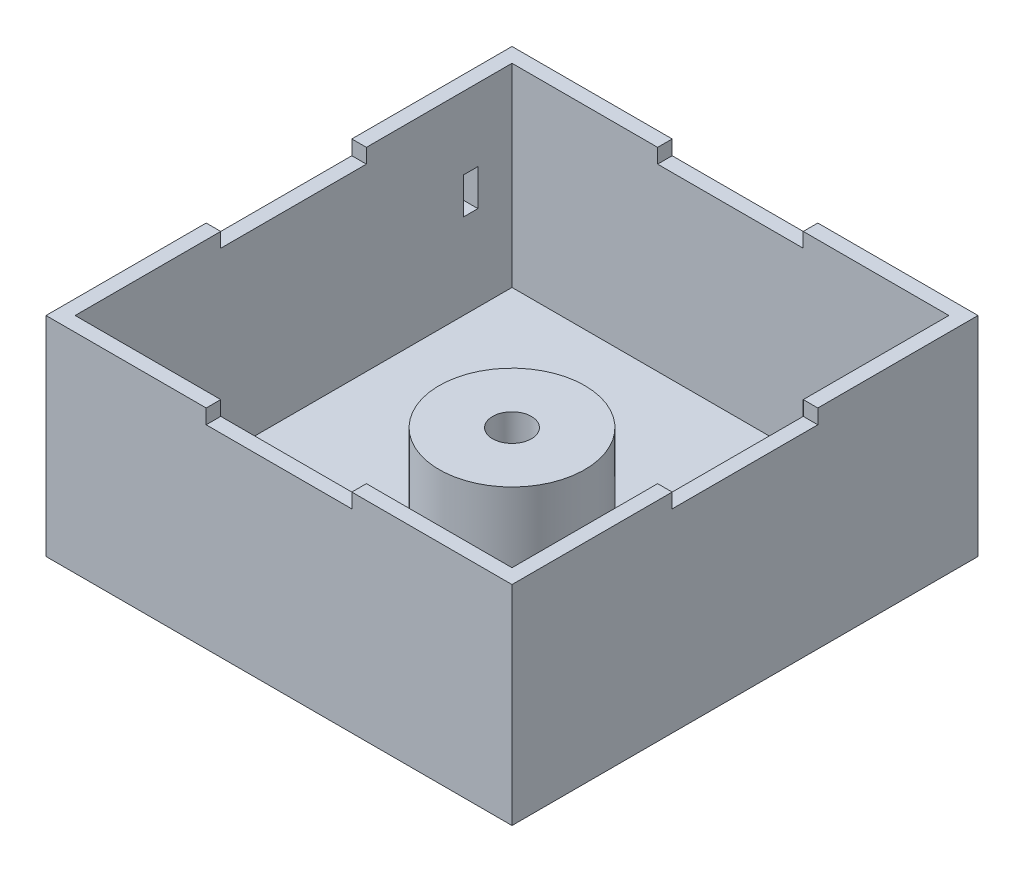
ISO-10303-21;
HEADER;
FILE_DESCRIPTION(('STEP AP214'),'2;1');
FILE_NAME('part.step','',(''),(''),'','','');
FILE_SCHEMA(('AUTOMOTIVE_DESIGN { 1 0 10303 214 1 1 1 1 }'));
ENDSEC;
DATA;
#1=APPLICATION_CONTEXT('core data for automotive mechanical design processes');
#2=APPLICATION_PROTOCOL_DEFINITION('international standard','automotive_design',2000,#1);
#3=PRODUCT_CONTEXT('',#1,'mechanical');
#4=PRODUCT('Part','Part','',(#3));
#5=PRODUCT_RELATED_PRODUCT_CATEGORY('part','',(#4));
#6=PRODUCT_DEFINITION_FORMATION('','',#4);
#7=PRODUCT_DEFINITION_CONTEXT('part definition',#1,'design');
#8=PRODUCT_DEFINITION('design','',#6,#7);
#9=PRODUCT_DEFINITION_SHAPE('','',#8);
#10=(LENGTH_UNIT() NAMED_UNIT(*) SI_UNIT(.MILLI.,.METRE.));
#11=(NAMED_UNIT(*) PLANE_ANGLE_UNIT() SI_UNIT($,.RADIAN.));
#12=(NAMED_UNIT(*) SI_UNIT($,.STERADIAN.) SOLID_ANGLE_UNIT());
#13=UNCERTAINTY_MEASURE_WITH_UNIT(LENGTH_MEASURE(1.E-05),#10,'distance_accuracy_value','');
#14=(GEOMETRIC_REPRESENTATION_CONTEXT(3) GLOBAL_UNCERTAINTY_ASSIGNED_CONTEXT((#13)) GLOBAL_UNIT_ASSIGNED_CONTEXT((#10,
#11,#12)) REPRESENTATION_CONTEXT('',''));
#15=CARTESIAN_POINT('',(0.,0.,0.));
#16=DIRECTION('',(0.,0.,1.));
#17=DIRECTION('',(1.,0.,0.));
#18=AXIS2_PLACEMENT_3D('',#15,#16,#17);
#19=CARTESIAN_POINT('',(0.,20.,0.));
#20=DIRECTION('',(0.,1.,0.));
#21=DIRECTION('',(0.,0.,1.));
#22=AXIS2_PLACEMENT_3D('',#19,#20,#21);
#23=PLANE('',#22);
#24=DIRECTION('',(1.,0.,0.));
#25=VECTOR('',#24,1.);
#26=CARTESIAN_POINT('',(48.,20.,15.));
#27=LINE('',#26,#25);
#28=CARTESIAN_POINT('',(45.,20.,15.));
#29=VERTEX_POINT('',#28);
#30=CARTESIAN_POINT('',(48.,20.,15.));
#31=VERTEX_POINT('',#30);
#32=EDGE_CURVE('E262',#29,#31,#27,.T.);
#33=ORIENTED_EDGE('',*,*,#32,.F.);
#34=DIRECTION('',(0.,0.,1.));
#35=VECTOR('',#34,1.);
#36=CARTESIAN_POINT('',(45.,20.,45.));
#37=LINE('',#36,#35);
#38=CARTESIAN_POINT('',(45.,20.,45.));
#39=VERTEX_POINT('',#38);
#40=EDGE_CURVE('E362',#29,#39,#37,.T.);
#41=ORIENTED_EDGE('',*,*,#40,.T.);
#42=DIRECTION('',(-1.,0.,0.));
#43=VECTOR('',#42,1.);
#44=CARTESIAN_POINT('',(45.,20.,45.));
#45=LINE('',#44,#43);
#46=CARTESIAN_POINT('',(15.0000000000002,20.,44.9999999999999));
#47=VERTEX_POINT('',#46);
#48=EDGE_CURVE('E367',#39,#47,#45,.T.);
#49=ORIENTED_EDGE('',*,*,#48,.T.);
#50=DIRECTION('',(0.,0.,-1.));
#51=VECTOR('',#50,1.);
#52=CARTESIAN_POINT('',(15.0000000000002,20.,47.9999999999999));
#53=LINE('',#52,#51);
#54=CARTESIAN_POINT('',(15.0000000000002,20.,47.9999999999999));
#55=VERTEX_POINT('',#54);
#56=EDGE_CURVE('E277',#55,#47,#53,.T.);
#57=ORIENTED_EDGE('',*,*,#56,.F.);
#58=DIRECTION('',(-1.,0.,0.));
#59=VECTOR('',#58,1.);
#60=CARTESIAN_POINT('',(48.,20.,48.));
#61=LINE('',#60,#59);
#62=CARTESIAN_POINT('',(48.,20.,48.));
#63=VERTEX_POINT('',#62);
#64=EDGE_CURVE('E398',#63,#55,#61,.T.);
#65=ORIENTED_EDGE('',*,*,#64,.F.);
#66=DIRECTION('',(0.,0.,1.));
#67=VECTOR('',#66,1.);
#68=CARTESIAN_POINT('',(48.,20.,48.));
#69=LINE('',#68,#67);
#70=EDGE_CURVE('E385',#31,#63,#69,.T.);
#71=ORIENTED_EDGE('',*,*,#70,.F.);
#72=EDGE_LOOP('',(#33,#41,#49,#57,#65,#71));
#73=FACE_BOUND('',#72,.T.);
#74=ADVANCED_FACE('F35',(#73),#23,.T.);
#75=DIRECTION('',(-1.,0.,0.));
#76=VECTOR('',#75,1.);
#77=CARTESIAN_POINT('',(48.,20.,-15.));
#78=LINE('',#77,#76);
#79=CARTESIAN_POINT('',(48.,20.,-15.));
#80=VERTEX_POINT('',#79);
#81=CARTESIAN_POINT('',(45.,20.,-15.));
#82=VERTEX_POINT('',#81);
#83=EDGE_CURVE('E270',#80,#82,#78,.T.);
#84=ORIENTED_EDGE('',*,*,#83,.F.);
#85=CARTESIAN_POINT('',(48.,20.,-48.));
#86=VERTEX_POINT('',#85);
#87=EDGE_CURVE('E394',#86,#80,#69,.T.);
#88=ORIENTED_EDGE('',*,*,#87,.F.);
#89=DIRECTION('',(1.,0.,0.));
#90=VECTOR('',#89,1.);
#91=CARTESIAN_POINT('',(48.,20.,-48.));
#92=LINE('',#91,#90);
#93=CARTESIAN_POINT('',(14.9999999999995,20.,-48.0000000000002));
#94=VERTEX_POINT('',#93);
#95=EDGE_CURVE('E405',#94,#86,#92,.T.);
#96=ORIENTED_EDGE('',*,*,#95,.F.);
#97=DIRECTION('',(0.,0.,-1.));
#98=VECTOR('',#97,1.);
#99=CARTESIAN_POINT('',(14.9999999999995,20.,-48.0000000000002));
#100=LINE('',#99,#98);
#101=CARTESIAN_POINT('',(14.9999999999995,20.,-45.0000000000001));
#102=VERTEX_POINT('',#101);
#103=EDGE_CURVE('E288',#102,#94,#100,.T.);
#104=ORIENTED_EDGE('',*,*,#103,.F.);
#105=DIRECTION('',(1.,0.,0.));
#106=VECTOR('',#105,1.);
#107=CARTESIAN_POINT('',(45.,20.,-45.));
#108=LINE('',#107,#106);
#109=CARTESIAN_POINT('',(45.,20.,-45.));
#110=VERTEX_POINT('',#109);
#111=EDGE_CURVE('E357',#102,#110,#108,.T.);
#112=ORIENTED_EDGE('',*,*,#111,.T.);
#113=EDGE_CURVE('E363',#110,#82,#37,.T.);
#114=ORIENTED_EDGE('',*,*,#113,.T.);
#115=EDGE_LOOP('',(#84,#88,#96,#104,#112,#114));
#116=FACE_BOUND('',#115,.T.);
#117=ADVANCED_FACE('F450',(#116),#23,.T.);
#118=DIRECTION('',(0.,0.,1.));
#119=VECTOR('',#118,1.);
#120=CARTESIAN_POINT('',(-14.9999999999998,20.,48.));
#121=LINE('',#120,#119);
#122=CARTESIAN_POINT('',(-14.9999999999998,20.,45.));
#123=VERTEX_POINT('',#122);
#124=CARTESIAN_POINT('',(-14.9999999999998,20.,48.));
#125=VERTEX_POINT('',#124);
#126=EDGE_CURVE('E310',#123,#125,#121,.T.);
#127=ORIENTED_EDGE('',*,*,#126,.F.);
#128=CARTESIAN_POINT('',(-45.,20.,45.));
#129=VERTEX_POINT('',#128);
#130=EDGE_CURVE('E366',#123,#129,#45,.T.);
#131=ORIENTED_EDGE('',*,*,#130,.T.);
#132=DIRECTION('',(0.,0.,-1.));
#133=VECTOR('',#132,1.);
#134=CARTESIAN_POINT('',(-45.,20.,45.));
#135=LINE('',#134,#133);
#136=CARTESIAN_POINT('',(-45.,20.,15.));
#137=VERTEX_POINT('',#136);
#138=EDGE_CURVE('E354',#129,#137,#135,.T.);
#139=ORIENTED_EDGE('',*,*,#138,.T.);
#140=DIRECTION('',(1.,0.,0.));
#141=VECTOR('',#140,1.);
#142=CARTESIAN_POINT('',(-48.,20.,15.));
#143=LINE('',#142,#141);
#144=CARTESIAN_POINT('',(-48.,20.,15.));
#145=VERTEX_POINT('',#144);
#146=EDGE_CURVE('E323',#145,#137,#143,.T.);
#147=ORIENTED_EDGE('',*,*,#146,.F.);
#148=DIRECTION('',(0.,0.,-1.));
#149=VECTOR('',#148,1.);
#150=CARTESIAN_POINT('',(-48.,20.,48.));
#151=LINE('',#150,#149);
#152=CARTESIAN_POINT('',(-48.,20.,48.));
#153=VERTEX_POINT('',#152);
#154=EDGE_CURVE('E402',#153,#145,#151,.T.);
#155=ORIENTED_EDGE('',*,*,#154,.F.);
#156=EDGE_CURVE('E397',#125,#153,#61,.T.);
#157=ORIENTED_EDGE('',*,*,#156,.F.);
#158=EDGE_LOOP('',(#127,#131,#139,#147,#155,#157));
#159=FACE_BOUND('',#158,.T.);
#160=ADVANCED_FACE('F446',(#159),#23,.T.);
#161=CARTESIAN_POINT('',(0.,-20.,0.));
#162=DIRECTION('',(0.,-1.,0.));
#163=DIRECTION('',(0.,0.,-1.));
#164=AXIS2_PLACEMENT_3D('',#161,#162,#163);
#165=PLANE('',#164);
#166=CARTESIAN_POINT('',(0.,-20.,0.));
#167=DIRECTION('',(0.,-1.,0.));
#168=DIRECTION('',(0.,0.,-1.));
#169=AXIS2_PLACEMENT_3D('',#166,#167,#168);
#170=CIRCLE('',#169,15.);
#171=CARTESIAN_POINT('',(0.,-20.,-15.));
#172=VERTEX_POINT('',#171);
#173=EDGE_CURVE('E43',#172,#172,#170,.T.);
#174=ORIENTED_EDGE('',*,*,#173,.T.);
#175=EDGE_LOOP('',(#174));
#176=FACE_BOUND('',#175,.T.);
#177=DIRECTION('',(0.,0.,-1.));
#178=VECTOR('',#177,1.);
#179=CARTESIAN_POINT('',(-45.,-20.,45.));
#180=LINE('',#179,#178);
#181=CARTESIAN_POINT('',(-45.,-20.,45.));
#182=VERTEX_POINT('',#181);
#183=CARTESIAN_POINT('',(-45.,-20.,-45.));
#184=VERTEX_POINT('',#183);
#185=EDGE_CURVE('E347',#182,#184,#180,.T.);
#186=ORIENTED_EDGE('',*,*,#185,.F.);
#187=DIRECTION('',(-1.,0.,0.));
#188=VECTOR('',#187,1.);
#189=CARTESIAN_POINT('',(45.,-20.,45.));
#190=LINE('',#189,#188);
#191=CARTESIAN_POINT('',(45.,-20.,45.));
#192=VERTEX_POINT('',#191);
#193=EDGE_CURVE('E379',#192,#182,#190,.T.);
#194=ORIENTED_EDGE('',*,*,#193,.F.);
#195=DIRECTION('',(0.,0.,1.));
#196=VECTOR('',#195,1.);
#197=CARTESIAN_POINT('',(45.,-20.,45.));
#198=LINE('',#197,#196);
#199=CARTESIAN_POINT('',(45.,-20.,-45.));
#200=VERTEX_POINT('',#199);
#201=EDGE_CURVE('E376',#200,#192,#198,.T.);
#202=ORIENTED_EDGE('',*,*,#201,.F.);
#203=DIRECTION('',(1.,0.,0.));
#204=VECTOR('',#203,1.);
#205=CARTESIAN_POINT('',(45.,-20.,-45.));
#206=LINE('',#205,#204);
#207=EDGE_CURVE('E373',#184,#200,#206,.T.);
#208=ORIENTED_EDGE('',*,*,#207,.F.);
#209=EDGE_LOOP('',(#186,#194,#202,#208));
#210=FACE_BOUND('',#209,.T.);
#211=ADVANCED_FACE('F432',(#176,#210),#165,.F.);
#212=CARTESIAN_POINT('',(0.,0.,0.));
#213=DIRECTION('',(0.,-1.,0.));
#214=DIRECTION('',(0.,0.,-1.));
#215=AXIS2_PLACEMENT_3D('',#212,#213,#214);
#216=PLANE('',#215);
#217=CARTESIAN_POINT('',(0.,0.,0.));
#218=DIRECTION('',(0.,-1.,0.));
#219=DIRECTION('',(0.,0.,-1.));
#220=AXIS2_PLACEMENT_3D('',#217,#218,#219);
#221=CIRCLE('',#220,4.);
#222=CARTESIAN_POINT('',(0.,0.,-4.));
#223=VERTEX_POINT('',#222);
#224=EDGE_CURVE('E810',#223,#223,#221,.T.);
#225=ORIENTED_EDGE('',*,*,#224,.T.);
#226=EDGE_LOOP('',(#225));
#227=FACE_BOUND('',#226,.T.);
#228=CARTESIAN_POINT('',(0.,0.,0.));
#229=DIRECTION('',(0.,-1.,0.));
#230=DIRECTION('',(0.,0.,-1.));
#231=AXIS2_PLACEMENT_3D('',#228,#229,#230);
#232=CIRCLE('',#231,15.);
#233=CARTESIAN_POINT('',(0.,0.,-15.));
#234=VERTEX_POINT('',#233);
#235=EDGE_CURVE('E12',#234,#234,#232,.T.);
#236=ORIENTED_EDGE('',*,*,#235,.F.);
#237=EDGE_LOOP('',(#236));
#238=FACE_BOUND('',#237,.T.);
#239=ADVANCED_FACE('F37',(#227,#238),#216,.F.);
#240=CARTESIAN_POINT('',(0.,-20.,0.));
#241=DIRECTION('',(0.,1.,0.));
#242=DIRECTION('',(0.,0.,1.));
#243=AXIS2_PLACEMENT_3D('',#240,#241,#242);
#244=CYLINDRICAL_SURFACE('',#243,15.);
#245=ORIENTED_EDGE('',*,*,#235,.T.);
#246=EDGE_LOOP('',(#245));
#247=FACE_BOUND('',#246,.T.);
#248=ORIENTED_EDGE('',*,*,#173,.F.);
#249=EDGE_LOOP('',(#248));
#250=FACE_BOUND('',#249,.T.);
#251=ADVANCED_FACE('F435',(#247,#250),#244,.T.);
#252=DIRECTION('',(0.,0.,1.));
#253=VECTOR('',#252,1.);
#254=CARTESIAN_POINT('',(-15.0000000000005,20.,-47.9999999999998));
#255=LINE('',#254,#253);
#256=CARTESIAN_POINT('',(-15.0000000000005,20.,-47.9999999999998));
#257=VERTEX_POINT('',#256);
#258=CARTESIAN_POINT('',(-15.0000000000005,20.,-44.9999999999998));
#259=VERTEX_POINT('',#258);
#260=EDGE_CURVE('E257',#257,#259,#255,.T.);
#261=ORIENTED_EDGE('',*,*,#260,.F.);
#262=CARTESIAN_POINT('',(-48.,20.,-48.));
#263=VERTEX_POINT('',#262);
#264=EDGE_CURVE('E406',#263,#257,#92,.T.);
#265=ORIENTED_EDGE('',*,*,#264,.F.);
#266=CARTESIAN_POINT('',(-48.,20.,-15.));
#267=VERTEX_POINT('',#266);
#268=EDGE_CURVE('E401',#267,#263,#151,.T.);
#269=ORIENTED_EDGE('',*,*,#268,.F.);
#270=DIRECTION('',(-1.,0.,0.));
#271=VECTOR('',#270,1.);
#272=CARTESIAN_POINT('',(-48.,20.,-15.));
#273=LINE('',#272,#271);
#274=CARTESIAN_POINT('',(-45.,20.,-15.));
#275=VERTEX_POINT('',#274);
#276=EDGE_CURVE('E334',#275,#267,#273,.T.);
#277=ORIENTED_EDGE('',*,*,#276,.F.);
#278=CARTESIAN_POINT('',(-45.,20.,-45.));
#279=VERTEX_POINT('',#278);
#280=EDGE_CURVE('E358',#275,#279,#135,.T.);
#281=ORIENTED_EDGE('',*,*,#280,.T.);
#282=EDGE_CURVE('E359',#279,#259,#108,.T.);
#283=ORIENTED_EDGE('',*,*,#282,.T.);
#284=EDGE_LOOP('',(#261,#265,#269,#277,#281,#283));
#285=FACE_BOUND('',#284,.T.);
#286=ADVANCED_FACE('F437',(#285),#23,.T.);
#287=CARTESIAN_POINT('',(-45.,20.,45.));
#288=DIRECTION('',(-1.,0.,0.));
#289=DIRECTION('',(0.,0.,1.));
#290=AXIS2_PLACEMENT_3D('',#287,#288,#289);
#291=PLANE('',#290);
#292=DIRECTION('',(0.,0.,-1.));
#293=VECTOR('',#292,1.);
#294=CARTESIAN_POINT('',(-45.,5.08021856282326,45.));
#295=LINE('',#294,#293);
#296=CARTESIAN_POINT('',(-45.,5.08021856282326,-34.978507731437));
#297=VERTEX_POINT('',#296);
#298=CARTESIAN_POINT('',(-45.,5.08021856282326,-37.978507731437));
#299=VERTEX_POINT('',#298);
#300=EDGE_CURVE('E251',#297,#299,#295,.T.);
#301=ORIENTED_EDGE('',*,*,#300,.T.);
#302=DIRECTION('',(0.,-1.,0.));
#303=VECTOR('',#302,1.);
#304=CARTESIAN_POINT('',(-45.,20.,-37.978507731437));
#305=LINE('',#304,#303);
#306=CARTESIAN_POINT('',(-45.,-2.41978143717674,-37.978507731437));
#307=VERTEX_POINT('',#306);
#308=EDGE_CURVE('E254',#299,#307,#305,.T.);
#309=ORIENTED_EDGE('',*,*,#308,.T.);
#310=DIRECTION('',(0.,0.,1.));
#311=VECTOR('',#310,1.);
#312=CARTESIAN_POINT('',(-45.,-2.41978143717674,45.));
#313=LINE('',#312,#311);
#314=CARTESIAN_POINT('',(-45.,-2.41978143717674,-34.978507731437));
#315=VERTEX_POINT('',#314);
#316=EDGE_CURVE('E246',#307,#315,#313,.T.);
#317=ORIENTED_EDGE('',*,*,#316,.T.);
#318=DIRECTION('',(0.,1.,0.));
#319=VECTOR('',#318,1.);
#320=CARTESIAN_POINT('',(-45.,20.,-34.978507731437));
#321=LINE('',#320,#319);
#322=EDGE_CURVE('E226',#315,#297,#321,.T.);
#323=ORIENTED_EDGE('',*,*,#322,.T.);
#324=EDGE_LOOP('',(#301,#309,#317,#323));
#325=FACE_BOUND('',#324,.T.);
#326=ORIENTED_EDGE('',*,*,#280,.F.);
#327=DIRECTION('',(0.,1.,0.));
#328=VECTOR('',#327,1.);
#329=CARTESIAN_POINT('',(-45.,17.,-15.));
#330=LINE('',#329,#328);
#331=CARTESIAN_POINT('',(-45.,17.,-15.));
#332=VERTEX_POINT('',#331);
#333=EDGE_CURVE('E348',#332,#275,#330,.T.);
#334=ORIENTED_EDGE('',*,*,#333,.F.);
#335=DIRECTION('',(0.,0.,-1.));
#336=VECTOR('',#335,1.);
#337=CARTESIAN_POINT('',(-45.,17.,-15.));
#338=LINE('',#337,#336);
#339=CARTESIAN_POINT('',(-45.,17.,15.));
#340=VERTEX_POINT('',#339);
#341=EDGE_CURVE('E337',#340,#332,#338,.T.);
#342=ORIENTED_EDGE('',*,*,#341,.F.);
#343=DIRECTION('',(0.,1.,0.));
#344=VECTOR('',#343,1.);
#345=CARTESIAN_POINT('',(-45.,17.,15.));
#346=LINE('',#345,#344);
#347=EDGE_CURVE('E350',#340,#137,#346,.T.);
#348=ORIENTED_EDGE('',*,*,#347,.T.);
#349=ORIENTED_EDGE('',*,*,#138,.F.);
#350=DIRECTION('',(0.,-1.,0.));
#351=VECTOR('',#350,1.);
#352=CARTESIAN_POINT('',(-45.,20.,45.));
#353=LINE('',#352,#351);
#354=EDGE_CURVE('E382',#129,#182,#353,.T.);
#355=ORIENTED_EDGE('',*,*,#354,.T.);
#356=ORIENTED_EDGE('',*,*,#185,.T.);
#357=DIRECTION('',(0.,-1.,0.));
#358=VECTOR('',#357,1.);
#359=CARTESIAN_POINT('',(-45.,20.,-45.));
#360=LINE('',#359,#358);
#361=EDGE_CURVE('E370',#279,#184,#360,.T.);
#362=ORIENTED_EDGE('',*,*,#361,.F.);
#363=EDGE_LOOP('',(#326,#334,#342,#348,#349,#355,#356,#362));
#364=FACE_BOUND('',#363,.T.);
#365=ADVANCED_FACE('F443',(#325,#364),#291,.F.);
#366=CARTESIAN_POINT('',(45.,20.,45.));
#367=DIRECTION('',(0.,0.,1.));
#368=DIRECTION('',(1.,0.,0.));
#369=AXIS2_PLACEMENT_3D('',#366,#367,#368);
#370=PLANE('',#369);
#371=ORIENTED_EDGE('',*,*,#130,.F.);
#372=DIRECTION('',(0.,1.,0.));
#373=VECTOR('',#372,1.);
#374=CARTESIAN_POINT('',(-14.9999999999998,17.,45.));
#375=LINE('',#374,#373);
#376=CARTESIAN_POINT('',(-14.9999999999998,17.,45.));
#377=VERTEX_POINT('',#376);
#378=EDGE_CURVE('E324',#377,#123,#375,.T.);
#379=ORIENTED_EDGE('',*,*,#378,.F.);
#380=DIRECTION('',(-1.,0.,0.));
#381=VECTOR('',#380,1.);
#382=CARTESIAN_POINT('',(-14.9999999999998,17.,45.));
#383=LINE('',#382,#381);
#384=CARTESIAN_POINT('',(15.0000000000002,17.,44.9999999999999));
#385=VERTEX_POINT('',#384);
#386=EDGE_CURVE('E313',#385,#377,#383,.T.);
#387=ORIENTED_EDGE('',*,*,#386,.F.);
#388=DIRECTION('',(0.,1.,0.));
#389=VECTOR('',#388,1.);
#390=CARTESIAN_POINT('',(15.0000000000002,17.,44.9999999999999));
#391=LINE('',#390,#389);
#392=EDGE_CURVE('E326',#385,#47,#391,.T.);
#393=ORIENTED_EDGE('',*,*,#392,.T.);
#394=ORIENTED_EDGE('',*,*,#48,.F.);
#395=DIRECTION('',(0.,-1.,0.));
#396=VECTOR('',#395,1.);
#397=CARTESIAN_POINT('',(45.,20.,45.));
#398=LINE('',#397,#396);
#399=EDGE_CURVE('E386',#39,#192,#398,.T.);
#400=ORIENTED_EDGE('',*,*,#399,.T.);
#401=ORIENTED_EDGE('',*,*,#193,.T.);
#402=ORIENTED_EDGE('',*,*,#354,.F.);
#403=EDGE_LOOP('',(#371,#379,#387,#393,#394,#400,#401,#402));
#404=FACE_BOUND('',#403,.T.);
#405=ADVANCED_FACE('F503',(#404),#370,.F.);
#406=CARTESIAN_POINT('',(45.,20.,45.));
#407=DIRECTION('',(1.,0.,0.));
#408=DIRECTION('',(0.,0.,-1.));
#409=AXIS2_PLACEMENT_3D('',#406,#407,#408);
#410=PLANE('',#409);
#411=ORIENTED_EDGE('',*,*,#40,.F.);
#412=DIRECTION('',(0.,1.,0.));
#413=VECTOR('',#412,1.);
#414=CARTESIAN_POINT('',(45.,17.,15.));
#415=LINE('',#414,#413);
#416=CARTESIAN_POINT('',(45.,17.,15.));
#417=VERTEX_POINT('',#416);
#418=EDGE_CURVE('E278',#417,#29,#415,.T.);
#419=ORIENTED_EDGE('',*,*,#418,.F.);
#420=DIRECTION('',(0.,0.,1.));
#421=VECTOR('',#420,1.);
#422=CARTESIAN_POINT('',(45.,17.,15.));
#423=LINE('',#422,#421);
#424=CARTESIAN_POINT('',(45.,17.,-15.));
#425=VERTEX_POINT('',#424);
#426=EDGE_CURVE('E265',#425,#417,#423,.T.);
#427=ORIENTED_EDGE('',*,*,#426,.F.);
#428=DIRECTION('',(0.,1.,0.));
#429=VECTOR('',#428,1.);
#430=CARTESIAN_POINT('',(45.,17.,-15.));
#431=LINE('',#430,#429);
#432=EDGE_CURVE('E280',#425,#82,#431,.T.);
#433=ORIENTED_EDGE('',*,*,#432,.T.);
#434=ORIENTED_EDGE('',*,*,#113,.F.);
#435=DIRECTION('',(0.,-1.,0.));
#436=VECTOR('',#435,1.);
#437=CARTESIAN_POINT('',(45.,20.,-45.));
#438=LINE('',#437,#436);
#439=EDGE_CURVE('E389',#110,#200,#438,.T.);
#440=ORIENTED_EDGE('',*,*,#439,.T.);
#441=ORIENTED_EDGE('',*,*,#201,.T.);
#442=ORIENTED_EDGE('',*,*,#399,.F.);
#443=EDGE_LOOP('',(#411,#419,#427,#433,#434,#440,#441,#442));
#444=FACE_BOUND('',#443,.T.);
#445=ADVANCED_FACE('F531',(#444),#410,.F.);
#446=CARTESIAN_POINT('',(45.,20.,-45.));
#447=DIRECTION('',(0.,0.,-1.));
#448=DIRECTION('',(-1.,0.,0.));
#449=AXIS2_PLACEMENT_3D('',#446,#447,#448);
#450=PLANE('',#449);
#451=ORIENTED_EDGE('',*,*,#111,.F.);
#452=DIRECTION('',(0.,1.,0.));
#453=VECTOR('',#452,1.);
#454=CARTESIAN_POINT('',(14.9999999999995,17.,-45.0000000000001));
#455=LINE('',#454,#453);
#456=CARTESIAN_POINT('',(14.9999999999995,17.,-45.0000000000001));
#457=VERTEX_POINT('',#456);
#458=EDGE_CURVE('E300',#457,#102,#455,.T.);
#459=ORIENTED_EDGE('',*,*,#458,.F.);
#460=DIRECTION('',(1.,0.,0.));
#461=VECTOR('',#460,1.);
#462=CARTESIAN_POINT('',(14.9999999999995,17.,-45.0000000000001));
#463=LINE('',#462,#461);
#464=CARTESIAN_POINT('',(-15.0000000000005,17.,-44.9999999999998));
#465=VERTEX_POINT('',#464);
#466=EDGE_CURVE('E291',#465,#457,#463,.T.);
#467=ORIENTED_EDGE('',*,*,#466,.F.);
#468=DIRECTION('',(0.,1.,0.));
#469=VECTOR('',#468,1.);
#470=CARTESIAN_POINT('',(-15.0000000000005,17.,-44.9999999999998));
#471=LINE('',#470,#469);
#472=EDGE_CURVE('E302',#465,#259,#471,.T.);
#473=ORIENTED_EDGE('',*,*,#472,.T.);
#474=ORIENTED_EDGE('',*,*,#282,.F.);
#475=ORIENTED_EDGE('',*,*,#361,.T.);
#476=ORIENTED_EDGE('',*,*,#207,.T.);
#477=ORIENTED_EDGE('',*,*,#439,.F.);
#478=EDGE_LOOP('',(#451,#459,#467,#473,#474,#475,#476,#477));
#479=FACE_BOUND('',#478,.T.);
#480=ADVANCED_FACE('F464',(#479),#450,.F.);
#481=CARTESIAN_POINT('',(0.,-23.,0.));
#482=DIRECTION('',(0.,-1.,0.));
#483=DIRECTION('',(0.,0.,-1.));
#484=AXIS2_PLACEMENT_3D('',#481,#482,#483);
#485=PLANE('',#484);
#486=CARTESIAN_POINT('',(0.,-23.,0.));
#487=DIRECTION('',(0.,1.,0.));
#488=DIRECTION('',(0.,0.,1.));
#489=AXIS2_PLACEMENT_3D('',#486,#487,#488);
#490=CIRCLE('',#489,4.);
#491=CARTESIAN_POINT('',(0.,-23.,4.));
#492=VERTEX_POINT('',#491);
#493=EDGE_CURVE('E812',#492,#492,#490,.T.);
#494=ORIENTED_EDGE('',*,*,#493,.T.);
#495=EDGE_LOOP('',(#494));
#496=FACE_BOUND('',#495,.T.);
#497=DIRECTION('',(-1.,0.,0.));
#498=VECTOR('',#497,1.);
#499=CARTESIAN_POINT('',(48.,-23.,48.));
#500=LINE('',#499,#498);
#501=CARTESIAN_POINT('',(48.,-23.,48.));
#502=VERTEX_POINT('',#501);
#503=CARTESIAN_POINT('',(-48.,-23.,48.));
#504=VERTEX_POINT('',#503);
#505=EDGE_CURVE('E409',#502,#504,#500,.T.);
#506=ORIENTED_EDGE('',*,*,#505,.T.);
#507=DIRECTION('',(0.,0.,-1.));
#508=VECTOR('',#507,1.);
#509=CARTESIAN_POINT('',(-48.,-23.,48.));
#510=LINE('',#509,#508);
#511=CARTESIAN_POINT('',(-48.,-23.,-48.));
#512=VERTEX_POINT('',#511);
#513=EDGE_CURVE('E412',#504,#512,#510,.T.);
#514=ORIENTED_EDGE('',*,*,#513,.T.);
#515=DIRECTION('',(1.,0.,0.));
#516=VECTOR('',#515,1.);
#517=CARTESIAN_POINT('',(-48.,-23.,-48.));
#518=LINE('',#517,#516);
#519=CARTESIAN_POINT('',(48.,-23.,-48.));
#520=VERTEX_POINT('',#519);
#521=EDGE_CURVE('E414',#512,#520,#518,.T.);
#522=ORIENTED_EDGE('',*,*,#521,.T.);
#523=DIRECTION('',(0.,0.,1.));
#524=VECTOR('',#523,1.);
#525=CARTESIAN_POINT('',(48.,-23.,-48.));
#526=LINE('',#525,#524);
#527=EDGE_CURVE('E416',#520,#502,#526,.T.);
#528=ORIENTED_EDGE('',*,*,#527,.T.);
#529=EDGE_LOOP('',(#506,#514,#522,#528));
#530=FACE_BOUND('',#529,.T.);
#531=ADVANCED_FACE('F460',(#496,#530),#485,.T.);
#532=CARTESIAN_POINT('',(48.,-23.,-48.));
#533=DIRECTION('',(-1.,0.,0.));
#534=DIRECTION('',(0.,0.,1.));
#535=AXIS2_PLACEMENT_3D('',#532,#533,#534);
#536=PLANE('',#535);
#537=DIRECTION('',(0.,0.,-1.));
#538=VECTOR('',#537,1.);
#539=CARTESIAN_POINT('',(48.,17.,15.));
#540=LINE('',#539,#538);
#541=CARTESIAN_POINT('',(48.,17.,15.));
#542=VERTEX_POINT('',#541);
#543=CARTESIAN_POINT('',(48.,17.,-15.));
#544=VERTEX_POINT('',#543);
#545=EDGE_CURVE('E258',#542,#544,#540,.T.);
#546=ORIENTED_EDGE('',*,*,#545,.F.);
#547=DIRECTION('',(0.,1.,0.));
#548=VECTOR('',#547,1.);
#549=CARTESIAN_POINT('',(48.,17.,15.));
#550=LINE('',#549,#548);
#551=EDGE_CURVE('E274',#542,#31,#550,.T.);
#552=ORIENTED_EDGE('',*,*,#551,.T.);
#553=ORIENTED_EDGE('',*,*,#70,.T.);
#554=DIRECTION('',(0.,1.,0.));
#555=VECTOR('',#554,1.);
#556=CARTESIAN_POINT('',(48.,-23.,48.));
#557=LINE('',#556,#555);
#558=EDGE_CURVE('E418',#502,#63,#557,.T.);
#559=ORIENTED_EDGE('',*,*,#558,.F.);
#560=ORIENTED_EDGE('',*,*,#527,.F.);
#561=DIRECTION('',(0.,1.,0.));
#562=VECTOR('',#561,1.);
#563=CARTESIAN_POINT('',(48.,-23.,-48.));
#564=LINE('',#563,#562);
#565=EDGE_CURVE('E421',#520,#86,#564,.T.);
#566=ORIENTED_EDGE('',*,*,#565,.T.);
#567=ORIENTED_EDGE('',*,*,#87,.T.);
#568=DIRECTION('',(0.,1.,0.));
#569=VECTOR('',#568,1.);
#570=CARTESIAN_POINT('',(48.,17.,-15.));
#571=LINE('',#570,#569);
#572=EDGE_CURVE('E269',#544,#80,#571,.T.);
#573=ORIENTED_EDGE('',*,*,#572,.F.);
#574=EDGE_LOOP('',(#546,#552,#553,#559,#560,#566,#567,#573));
#575=FACE_BOUND('',#574,.T.);
#576=ADVANCED_FACE('F463',(#575),#536,.F.);
#577=CARTESIAN_POINT('',(-48.,-23.,-48.));
#578=DIRECTION('',(0.,0.,1.));
#579=DIRECTION('',(1.,0.,0.));
#580=AXIS2_PLACEMENT_3D('',#577,#578,#579);
#581=PLANE('',#580);
#582=DIRECTION('',(-1.,0.,0.));
#583=VECTOR('',#582,1.);
#584=CARTESIAN_POINT('',(14.9999999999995,17.,-48.0000000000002));
#585=LINE('',#584,#583);
#586=CARTESIAN_POINT('',(14.9999999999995,17.,-48.));
#587=VERTEX_POINT('',#586);
#588=CARTESIAN_POINT('',(-15.0000000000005,17.,-47.9999999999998));
#589=VERTEX_POINT('',#588);
#590=EDGE_CURVE('E284',#587,#589,#585,.T.);
#591=ORIENTED_EDGE('',*,*,#590,.F.);
#592=DIRECTION('',(0.,1.,0.));
#593=VECTOR('',#592,1.);
#594=CARTESIAN_POINT('',(14.9999999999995,17.,-48.0000000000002));
#595=LINE('',#594,#593);
#596=EDGE_CURVE('E272',#587,#94,#595,.T.);
#597=ORIENTED_EDGE('',*,*,#596,.T.);
#598=ORIENTED_EDGE('',*,*,#95,.T.);
#599=ORIENTED_EDGE('',*,*,#565,.F.);
#600=ORIENTED_EDGE('',*,*,#521,.F.);
#601=DIRECTION('',(0.,1.,0.));
#602=VECTOR('',#601,1.);
#603=CARTESIAN_POINT('',(-48.,-23.,-48.));
#604=LINE('',#603,#602);
#605=EDGE_CURVE('E424',#512,#263,#604,.T.);
#606=ORIENTED_EDGE('',*,*,#605,.T.);
#607=ORIENTED_EDGE('',*,*,#264,.T.);
#608=DIRECTION('',(0.,1.,0.));
#609=VECTOR('',#608,1.);
#610=CARTESIAN_POINT('',(-15.0000000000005,17.,-47.9999999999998));
#611=LINE('',#610,#609);
#612=EDGE_CURVE('E295',#589,#257,#611,.T.);
#613=ORIENTED_EDGE('',*,*,#612,.F.);
#614=EDGE_LOOP('',(#591,#597,#598,#599,#600,#606,#607,#613));
#615=FACE_BOUND('',#614,.T.);
#616=ADVANCED_FACE('F470',(#615),#581,.F.);
#617=CARTESIAN_POINT('',(-48.,-23.,48.));
#618=DIRECTION('',(1.,0.,0.));
#619=DIRECTION('',(0.,0.,-1.));
#620=AXIS2_PLACEMENT_3D('',#617,#618,#619);
#621=PLANE('',#620);
#622=DIRECTION('',(0.,0.,1.));
#623=VECTOR('',#622,1.);
#624=CARTESIAN_POINT('',(-48.,-2.41978143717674,-37.978507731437));
#625=LINE('',#624,#623);
#626=CARTESIAN_POINT('',(-48.,-2.41978143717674,-37.978507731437));
#627=VERTEX_POINT('',#626);
#628=CARTESIAN_POINT('',(-48.,-2.41978143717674,-34.978507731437));
#629=VERTEX_POINT('',#628);
#630=EDGE_CURVE('E232',#627,#629,#625,.T.);
#631=ORIENTED_EDGE('',*,*,#630,.F.);
#632=DIRECTION('',(0.,-1.,0.));
#633=VECTOR('',#632,1.);
#634=CARTESIAN_POINT('',(-48.,5.08021856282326,-37.978507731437));
#635=LINE('',#634,#633);
#636=CARTESIAN_POINT('',(-48.,5.08021856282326,-37.978507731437));
#637=VERTEX_POINT('',#636);
#638=EDGE_CURVE('E58',#637,#627,#635,.T.);
#639=ORIENTED_EDGE('',*,*,#638,.F.);
#640=DIRECTION('',(0.,0.,-1.));
#641=VECTOR('',#640,1.);
#642=CARTESIAN_POINT('',(-48.,5.08021856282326,-37.978507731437));
#643=LINE('',#642,#641);
#644=CARTESIAN_POINT('',(-48.,5.08021856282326,-34.978507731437));
#645=VERTEX_POINT('',#644);
#646=EDGE_CURVE('E239',#645,#637,#643,.T.);
#647=ORIENTED_EDGE('',*,*,#646,.F.);
#648=DIRECTION('',(0.,1.,0.));
#649=VECTOR('',#648,1.);
#650=CARTESIAN_POINT('',(-48.,5.08021856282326,-34.978507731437));
#651=LINE('',#650,#649);
#652=EDGE_CURVE('E223',#629,#645,#651,.T.);
#653=ORIENTED_EDGE('',*,*,#652,.F.);
#654=EDGE_LOOP('',(#631,#639,#647,#653));
#655=FACE_BOUND('',#654,.T.);
#656=DIRECTION('',(0.,0.,1.));
#657=VECTOR('',#656,1.);
#658=CARTESIAN_POINT('',(-48.,17.,-15.));
#659=LINE('',#658,#657);
#660=CARTESIAN_POINT('',(-48.,17.,-15.));
#661=VERTEX_POINT('',#660);
#662=CARTESIAN_POINT('',(-48.,17.,15.));
#663=VERTEX_POINT('',#662);
#664=EDGE_CURVE('E330',#661,#663,#659,.T.);
#665=ORIENTED_EDGE('',*,*,#664,.F.);
#666=DIRECTION('',(0.,1.,0.));
#667=VECTOR('',#666,1.);
#668=CARTESIAN_POINT('',(-48.,17.,-15.));
#669=LINE('',#668,#667);
#670=EDGE_CURVE('E344',#661,#267,#669,.T.);
#671=ORIENTED_EDGE('',*,*,#670,.T.);
#672=ORIENTED_EDGE('',*,*,#268,.T.);
#673=ORIENTED_EDGE('',*,*,#605,.F.);
#674=ORIENTED_EDGE('',*,*,#513,.F.);
#675=DIRECTION('',(0.,1.,0.));
#676=VECTOR('',#675,1.);
#677=CARTESIAN_POINT('',(-48.,-23.,48.));
#678=LINE('',#677,#676);
#679=EDGE_CURVE('E427',#504,#153,#678,.T.);
#680=ORIENTED_EDGE('',*,*,#679,.T.);
#681=ORIENTED_EDGE('',*,*,#154,.T.);
#682=DIRECTION('',(0.,1.,0.));
#683=VECTOR('',#682,1.);
#684=CARTESIAN_POINT('',(-48.,17.,15.));
#685=LINE('',#684,#683);
#686=EDGE_CURVE('E341',#663,#145,#685,.T.);
#687=ORIENTED_EDGE('',*,*,#686,.F.);
#688=EDGE_LOOP('',(#665,#671,#672,#673,#674,#680,#681,#687));
#689=FACE_BOUND('',#688,.T.);
#690=ADVANCED_FACE('F236',(#655,#689),#621,.F.);
#691=CARTESIAN_POINT('',(48.,-23.,48.));
#692=DIRECTION('',(0.,0.,-1.));
#693=DIRECTION('',(-1.,0.,0.));
#694=AXIS2_PLACEMENT_3D('',#691,#692,#693);
#695=PLANE('',#694);
#696=DIRECTION('',(1.,0.,0.));
#697=VECTOR('',#696,1.);
#698=CARTESIAN_POINT('',(-14.9999999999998,17.,48.));
#699=LINE('',#698,#697);
#700=CARTESIAN_POINT('',(-14.9999999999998,17.,48.));
#701=VERTEX_POINT('',#700);
#702=CARTESIAN_POINT('',(15.0000000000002,17.,47.9999999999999));
#703=VERTEX_POINT('',#702);
#704=EDGE_CURVE('E306',#701,#703,#699,.T.);
#705=ORIENTED_EDGE('',*,*,#704,.F.);
#706=DIRECTION('',(0.,1.,0.));
#707=VECTOR('',#706,1.);
#708=CARTESIAN_POINT('',(-14.9999999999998,17.,48.));
#709=LINE('',#708,#707);
#710=EDGE_CURVE('E320',#701,#125,#709,.T.);
#711=ORIENTED_EDGE('',*,*,#710,.T.);
#712=ORIENTED_EDGE('',*,*,#156,.T.);
#713=ORIENTED_EDGE('',*,*,#679,.F.);
#714=ORIENTED_EDGE('',*,*,#505,.F.);
#715=ORIENTED_EDGE('',*,*,#558,.T.);
#716=ORIENTED_EDGE('',*,*,#64,.T.);
#717=DIRECTION('',(0.,1.,0.));
#718=VECTOR('',#717,1.);
#719=CARTESIAN_POINT('',(15.0000000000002,17.,47.9999999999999));
#720=LINE('',#719,#718);
#721=EDGE_CURVE('E317',#703,#55,#720,.T.);
#722=ORIENTED_EDGE('',*,*,#721,.F.);
#723=EDGE_LOOP('',(#705,#711,#712,#713,#714,#715,#716,#722));
#724=FACE_BOUND('',#723,.T.);
#725=ADVANCED_FACE('F476',(#724),#695,.F.);
#726=CARTESIAN_POINT('',(-48.,17.,-15.));
#727=DIRECTION('',(0.,0.,-1.));
#728=DIRECTION('',(-1.,0.,0.));
#729=AXIS2_PLACEMENT_3D('',#726,#727,#728);
#730=PLANE('',#729);
#731=ORIENTED_EDGE('',*,*,#276,.T.);
#732=ORIENTED_EDGE('',*,*,#670,.F.);
#733=DIRECTION('',(-1.,0.,0.));
#734=VECTOR('',#733,1.);
#735=CARTESIAN_POINT('',(-48.,17.,-15.));
#736=LINE('',#735,#734);
#737=EDGE_CURVE('E339',#332,#661,#736,.T.);
#738=ORIENTED_EDGE('',*,*,#737,.F.);
#739=ORIENTED_EDGE('',*,*,#333,.T.);
#740=EDGE_LOOP('',(#731,#732,#738,#739));
#741=FACE_BOUND('',#740,.T.);
#742=ADVANCED_FACE('F478',(#741),#730,.F.);
#743=CARTESIAN_POINT('',(-48.,17.,15.));
#744=DIRECTION('',(0.,0.,1.));
#745=DIRECTION('',(1.,0.,0.));
#746=AXIS2_PLACEMENT_3D('',#743,#744,#745);
#747=PLANE('',#746);
#748=ORIENTED_EDGE('',*,*,#146,.T.);
#749=ORIENTED_EDGE('',*,*,#347,.F.);
#750=DIRECTION('',(1.,0.,0.));
#751=VECTOR('',#750,1.);
#752=CARTESIAN_POINT('',(-48.,17.,15.));
#753=LINE('',#752,#751);
#754=EDGE_CURVE('E333',#663,#340,#753,.T.);
#755=ORIENTED_EDGE('',*,*,#754,.F.);
#756=ORIENTED_EDGE('',*,*,#686,.T.);
#757=EDGE_LOOP('',(#748,#749,#755,#756));
#758=FACE_BOUND('',#757,.T.);
#759=ADVANCED_FACE('F483',(#758),#747,.F.);
#760=CARTESIAN_POINT('',(0.,17.,0.));
#761=DIRECTION('',(0.,1.,0.));
#762=DIRECTION('',(0.,0.,1.));
#763=AXIS2_PLACEMENT_3D('',#760,#761,#762);
#764=PLANE('',#763);
#765=ORIENTED_EDGE('',*,*,#664,.T.);
#766=ORIENTED_EDGE('',*,*,#754,.T.);
#767=ORIENTED_EDGE('',*,*,#341,.T.);
#768=ORIENTED_EDGE('',*,*,#737,.T.);
#769=EDGE_LOOP('',(#765,#766,#767,#768));
#770=FACE_BOUND('',#769,.T.);
#771=ADVANCED_FACE('F547',(#770),#764,.T.);
#772=CARTESIAN_POINT('',(-14.9999999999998,17.,48.));
#773=DIRECTION('',(-1.,0.,0.));
#774=DIRECTION('',(0.,0.,1.));
#775=AXIS2_PLACEMENT_3D('',#772,#773,#774);
#776=PLANE('',#775);
#777=ORIENTED_EDGE('',*,*,#126,.T.);
#778=ORIENTED_EDGE('',*,*,#710,.F.);
#779=DIRECTION('',(0.,0.,1.));
#780=VECTOR('',#779,1.);
#781=CARTESIAN_POINT('',(-14.9999999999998,17.,48.));
#782=LINE('',#781,#780);
#783=EDGE_CURVE('E315',#377,#701,#782,.T.);
#784=ORIENTED_EDGE('',*,*,#783,.F.);
#785=ORIENTED_EDGE('',*,*,#378,.T.);
#786=EDGE_LOOP('',(#777,#778,#784,#785));
#787=FACE_BOUND('',#786,.T.);
#788=ADVANCED_FACE('F496',(#787),#776,.F.);
#789=CARTESIAN_POINT('',(15.0000000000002,17.,47.9999999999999));
#790=DIRECTION('',(1.,0.,0.));
#791=DIRECTION('',(0.,0.,-1.));
#792=AXIS2_PLACEMENT_3D('',#789,#790,#791);
#793=PLANE('',#792);
#794=ORIENTED_EDGE('',*,*,#56,.T.);
#795=ORIENTED_EDGE('',*,*,#392,.F.);
#796=DIRECTION('',(0.,0.,-1.));
#797=VECTOR('',#796,1.);
#798=CARTESIAN_POINT('',(15.0000000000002,17.,47.9999999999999));
#799=LINE('',#798,#797);
#800=EDGE_CURVE('E309',#703,#385,#799,.T.);
#801=ORIENTED_EDGE('',*,*,#800,.F.);
#802=ORIENTED_EDGE('',*,*,#721,.T.);
#803=EDGE_LOOP('',(#794,#795,#801,#802));
#804=FACE_BOUND('',#803,.T.);
#805=ADVANCED_FACE('F528',(#804),#793,.F.);
#806=CARTESIAN_POINT('',(0.,17.,0.));
#807=DIRECTION('',(0.,1.,0.));
#808=DIRECTION('',(1.,0.,0.));
#809=AXIS2_PLACEMENT_3D('',#806,#807,#808);
#810=PLANE('',#809);
#811=ORIENTED_EDGE('',*,*,#704,.T.);
#812=ORIENTED_EDGE('',*,*,#800,.T.);
#813=ORIENTED_EDGE('',*,*,#386,.T.);
#814=ORIENTED_EDGE('',*,*,#783,.T.);
#815=EDGE_LOOP('',(#811,#812,#813,#814));
#816=FACE_BOUND('',#815,.T.);
#817=ADVANCED_FACE('F491',(#816),#810,.T.);
#818=CARTESIAN_POINT('',(14.9999999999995,17.,-48.0000000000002));
#819=DIRECTION('',(1.,0.,0.));
#820=DIRECTION('',(0.,0.,-1.));
#821=AXIS2_PLACEMENT_3D('',#818,#819,#820);
#822=PLANE('',#821);
#823=ORIENTED_EDGE('',*,*,#103,.T.);
#824=ORIENTED_EDGE('',*,*,#596,.F.);
#825=DIRECTION('',(0.,0.,-1.));
#826=VECTOR('',#825,1.);
#827=CARTESIAN_POINT('',(14.9999999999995,17.,-48.0000000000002));
#828=LINE('',#827,#826);
#829=EDGE_CURVE('E293',#457,#587,#828,.T.);
#830=ORIENTED_EDGE('',*,*,#829,.F.);
#831=ORIENTED_EDGE('',*,*,#458,.T.);
#832=EDGE_LOOP('',(#823,#824,#830,#831));
#833=FACE_BOUND('',#832,.T.);
#834=ADVANCED_FACE('F656',(#833),#822,.F.);
#835=CARTESIAN_POINT('',(-15.0000000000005,17.,-47.9999999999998));
#836=DIRECTION('',(-1.,0.,0.));
#837=DIRECTION('',(0.,0.,1.));
#838=AXIS2_PLACEMENT_3D('',#835,#836,#837);
#839=PLANE('',#838);
#840=ORIENTED_EDGE('',*,*,#260,.T.);
#841=ORIENTED_EDGE('',*,*,#472,.F.);
#842=DIRECTION('',(0.,0.,1.));
#843=VECTOR('',#842,1.);
#844=CARTESIAN_POINT('',(-15.0000000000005,17.,-47.9999999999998));
#845=LINE('',#844,#843);
#846=EDGE_CURVE('E287',#589,#465,#845,.T.);
#847=ORIENTED_EDGE('',*,*,#846,.F.);
#848=ORIENTED_EDGE('',*,*,#612,.T.);
#849=EDGE_LOOP('',(#840,#841,#847,#848));
#850=FACE_BOUND('',#849,.T.);
#851=ADVANCED_FACE('F654',(#850),#839,.F.);
#852=CARTESIAN_POINT('',(0.,17.,0.));
#853=DIRECTION('',(0.,1.,0.));
#854=DIRECTION('',(-1.,0.,0.));
#855=AXIS2_PLACEMENT_3D('',#852,#853,#854);
#856=PLANE('',#855);
#857=ORIENTED_EDGE('',*,*,#590,.T.);
#858=ORIENTED_EDGE('',*,*,#846,.T.);
#859=ORIENTED_EDGE('',*,*,#466,.T.);
#860=ORIENTED_EDGE('',*,*,#829,.T.);
#861=EDGE_LOOP('',(#857,#858,#859,#860));
#862=FACE_BOUND('',#861,.T.);
#863=ADVANCED_FACE('F647',(#862),#856,.T.);
#864=CARTESIAN_POINT('',(48.,17.,15.));
#865=DIRECTION('',(0.,0.,1.));
#866=DIRECTION('',(1.,0.,0.));
#867=AXIS2_PLACEMENT_3D('',#864,#865,#866);
#868=PLANE('',#867);
#869=ORIENTED_EDGE('',*,*,#32,.T.);
#870=ORIENTED_EDGE('',*,*,#551,.F.);
#871=DIRECTION('',(1.,0.,0.));
#872=VECTOR('',#871,1.);
#873=CARTESIAN_POINT('',(48.,17.,15.));
#874=LINE('',#873,#872);
#875=EDGE_CURVE('E267',#417,#542,#874,.T.);
#876=ORIENTED_EDGE('',*,*,#875,.F.);
#877=ORIENTED_EDGE('',*,*,#418,.T.);
#878=EDGE_LOOP('',(#869,#870,#876,#877));
#879=FACE_BOUND('',#878,.T.);
#880=ADVANCED_FACE('F644',(#879),#868,.F.);
#881=CARTESIAN_POINT('',(48.,17.,-15.));
#882=DIRECTION('',(0.,0.,-1.));
#883=DIRECTION('',(-1.,0.,0.));
#884=AXIS2_PLACEMENT_3D('',#881,#882,#883);
#885=PLANE('',#884);
#886=ORIENTED_EDGE('',*,*,#83,.T.);
#887=ORIENTED_EDGE('',*,*,#432,.F.);
#888=DIRECTION('',(-1.,0.,0.));
#889=VECTOR('',#888,1.);
#890=CARTESIAN_POINT('',(48.,17.,-15.));
#891=LINE('',#890,#889);
#892=EDGE_CURVE('E261',#544,#425,#891,.T.);
#893=ORIENTED_EDGE('',*,*,#892,.F.);
#894=ORIENTED_EDGE('',*,*,#572,.T.);
#895=EDGE_LOOP('',(#886,#887,#893,#894));
#896=FACE_BOUND('',#895,.T.);
#897=ADVANCED_FACE('F642',(#896),#885,.F.);
#898=CARTESIAN_POINT('',(0.,17.,0.));
#899=DIRECTION('',(0.,1.,0.));
#900=DIRECTION('',(0.,0.,-1.));
#901=AXIS2_PLACEMENT_3D('',#898,#899,#900);
#902=PLANE('',#901);
#903=ORIENTED_EDGE('',*,*,#545,.T.);
#904=ORIENTED_EDGE('',*,*,#892,.T.);
#905=ORIENTED_EDGE('',*,*,#426,.T.);
#906=ORIENTED_EDGE('',*,*,#875,.T.);
#907=EDGE_LOOP('',(#903,#904,#905,#906));
#908=FACE_BOUND('',#907,.T.);
#909=ADVANCED_FACE('F599',(#908),#902,.T.);
#910=CARTESIAN_POINT('',(-38.,5.08021856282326,-37.978507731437));
#911=DIRECTION('',(0.,0.,-1.));
#912=DIRECTION('',(-1.,0.,0.));
#913=AXIS2_PLACEMENT_3D('',#910,#911,#912);
#914=PLANE('',#913);
#915=DIRECTION('',(-1.,0.,0.));
#916=VECTOR('',#915,1.);
#917=CARTESIAN_POINT('',(-38.,5.08021856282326,-37.978507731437));
#918=LINE('',#917,#916);
#919=EDGE_CURVE('E244',#299,#637,#918,.T.);
#920=ORIENTED_EDGE('',*,*,#919,.T.);
#921=ORIENTED_EDGE('',*,*,#638,.T.);
#922=DIRECTION('',(-1.,0.,0.));
#923=VECTOR('',#922,1.);
#924=CARTESIAN_POINT('',(-38.,-2.41978143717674,-37.978507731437));
#925=LINE('',#924,#923);
#926=EDGE_CURVE('E229',#307,#627,#925,.T.);
#927=ORIENTED_EDGE('',*,*,#926,.F.);
#928=ORIENTED_EDGE('',*,*,#308,.F.);
#929=EDGE_LOOP('',(#920,#921,#927,#928));
#930=FACE_BOUND('',#929,.T.);
#931=ADVANCED_FACE('F593',(#930),#914,.F.);
#932=CARTESIAN_POINT('',(-38.,5.08021856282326,-37.978507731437));
#933=DIRECTION('',(0.,1.,0.));
#934=DIRECTION('',(0.,0.,1.));
#935=AXIS2_PLACEMENT_3D('',#932,#933,#934);
#936=PLANE('',#935);
#937=DIRECTION('',(-1.,0.,0.));
#938=VECTOR('',#937,1.);
#939=CARTESIAN_POINT('',(-38.,5.08021856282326,-34.978507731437));
#940=LINE('',#939,#938);
#941=EDGE_CURVE('E228',#297,#645,#940,.T.);
#942=ORIENTED_EDGE('',*,*,#941,.T.);
#943=ORIENTED_EDGE('',*,*,#646,.T.);
#944=ORIENTED_EDGE('',*,*,#919,.F.);
#945=ORIENTED_EDGE('',*,*,#300,.F.);
#946=EDGE_LOOP('',(#942,#943,#944,#945));
#947=FACE_BOUND('',#946,.T.);
#948=ADVANCED_FACE('F598',(#947),#936,.F.);
#949=CARTESIAN_POINT('',(-38.,5.08021856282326,-34.978507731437));
#950=DIRECTION('',(0.,0.,1.));
#951=DIRECTION('',(1.,0.,0.));
#952=AXIS2_PLACEMENT_3D('',#949,#950,#951);
#953=PLANE('',#952);
#954=DIRECTION('',(-1.,0.,0.));
#955=VECTOR('',#954,1.);
#956=CARTESIAN_POINT('',(-38.,-2.41978143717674,-34.978507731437));
#957=LINE('',#956,#955);
#958=EDGE_CURVE('E50',#315,#629,#957,.T.);
#959=ORIENTED_EDGE('',*,*,#958,.T.);
#960=ORIENTED_EDGE('',*,*,#652,.T.);
#961=ORIENTED_EDGE('',*,*,#941,.F.);
#962=ORIENTED_EDGE('',*,*,#322,.F.);
#963=EDGE_LOOP('',(#959,#960,#961,#962));
#964=FACE_BOUND('',#963,.T.);
#965=ADVANCED_FACE('F220',(#964),#953,.F.);
#966=CARTESIAN_POINT('',(-38.,-2.41978143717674,-37.978507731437));
#967=DIRECTION('',(0.,-1.,0.));
#968=DIRECTION('',(0.,0.,-1.));
#969=AXIS2_PLACEMENT_3D('',#966,#967,#968);
#970=PLANE('',#969);
#971=ORIENTED_EDGE('',*,*,#926,.T.);
#972=ORIENTED_EDGE('',*,*,#630,.T.);
#973=ORIENTED_EDGE('',*,*,#958,.F.);
#974=ORIENTED_EDGE('',*,*,#316,.F.);
#975=EDGE_LOOP('',(#971,#972,#973,#974));
#976=FACE_BOUND('',#975,.T.);
#977=ADVANCED_FACE('F233',(#976),#970,.F.);
#978=CARTESIAN_POINT('',(0.,-23.,0.));
#979=DIRECTION('',(0.,1.,0.));
#980=DIRECTION('',(0.,0.,1.));
#981=AXIS2_PLACEMENT_3D('',#978,#979,#980);
#982=CYLINDRICAL_SURFACE('',#981,4.);
#983=ORIENTED_EDGE('',*,*,#493,.F.);
#984=EDGE_LOOP('',(#983));
#985=FACE_BOUND('',#984,.T.);
#986=ORIENTED_EDGE('',*,*,#224,.F.);
#987=EDGE_LOOP('',(#986));
#988=FACE_BOUND('',#987,.T.);
#989=ADVANCED_FACE('F625',(#985,#988),#982,.F.);
#990=CLOSED_SHELL('',(#74,#117,#160,#211,#239,#251,#286,#365,#405,#445,#480,#531,#576,#616,#690,
#725,#742,#759,#771,#788,#805,#817,#834,#851,#863,#880,#897,#909,#931,#948,#965,#977,#989));
#991=MANIFOLD_SOLID_BREP('B2',#990);
#992=ADVANCED_BREP_SHAPE_REPRESENTATION('',(#18,#991),#14);
#993=SHAPE_DEFINITION_REPRESENTATION(#9,#992);
ENDSEC;
END-ISO-10303-21;
